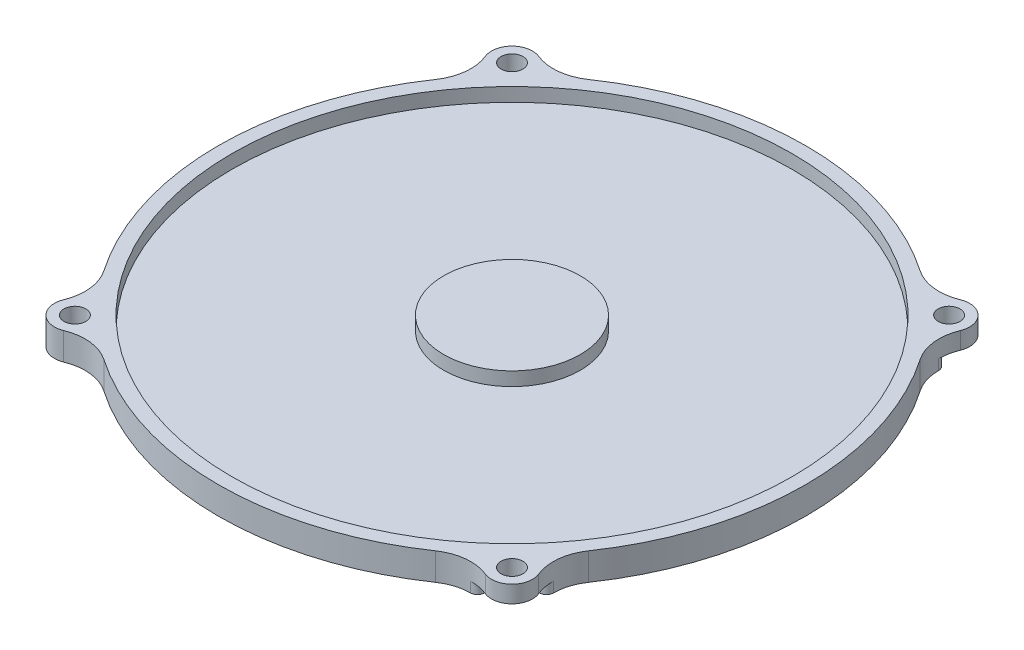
ISO-10303-21;
HEADER;
FILE_DESCRIPTION(('STEP AP214'),'2;1');
FILE_NAME('part.step','',(''),(''),'','','');
FILE_SCHEMA(('AUTOMOTIVE_DESIGN { 1 0 10303 214 1 1 1 1 }'));
ENDSEC;
DATA;
#1=APPLICATION_CONTEXT('core data for automotive mechanical design processes');
#2=APPLICATION_PROTOCOL_DEFINITION('international standard','automotive_design',2000,#1);
#3=PRODUCT_CONTEXT('',#1,'mechanical');
#4=PRODUCT('Part','Part','',(#3));
#5=PRODUCT_RELATED_PRODUCT_CATEGORY('part','',(#4));
#6=PRODUCT_DEFINITION_FORMATION('','',#4);
#7=PRODUCT_DEFINITION_CONTEXT('part definition',#1,'design');
#8=PRODUCT_DEFINITION('design','',#6,#7);
#9=PRODUCT_DEFINITION_SHAPE('','',#8);
#10=(LENGTH_UNIT() NAMED_UNIT(*) SI_UNIT(.MILLI.,.METRE.));
#11=(NAMED_UNIT(*) PLANE_ANGLE_UNIT() SI_UNIT($,.RADIAN.));
#12=(NAMED_UNIT(*) SI_UNIT($,.STERADIAN.) SOLID_ANGLE_UNIT());
#13=UNCERTAINTY_MEASURE_WITH_UNIT(LENGTH_MEASURE(1.E-05),#10,'distance_accuracy_value','');
#14=(GEOMETRIC_REPRESENTATION_CONTEXT(3) GLOBAL_UNCERTAINTY_ASSIGNED_CONTEXT((#13)) GLOBAL_UNIT_ASSIGNED_CONTEXT((#10,
#11,#12)) REPRESENTATION_CONTEXT('',''));
#15=CARTESIAN_POINT('',(0.,0.,0.));
#16=DIRECTION('',(0.,0.,1.));
#17=DIRECTION('',(1.,0.,0.));
#18=AXIS2_PLACEMENT_3D('',#15,#16,#17);
#19=CARTESIAN_POINT('',(31.9999999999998,4.,32.0000000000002));
#20=DIRECTION('',(0.,-1.,0.));
#21=DIRECTION('',(0.,0.,-1.));
#22=AXIS2_PLACEMENT_3D('',#19,#20,#21);
#23=CYLINDRICAL_SURFACE('',#22,3.);
#24=CARTESIAN_POINT('',(32.0000000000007,1.5,32.));
#25=DIRECTION('',(0.,-1.,0.));
#26=DIRECTION('',(0.,0.,-1.));
#27=AXIS2_PLACEMENT_3D('',#24,#25,#26);
#28=CIRCLE('',#27,2.99999999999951);
#29=CARTESIAN_POINT('',(34.7793221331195,1.5,30.8706778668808));
#30=VERTEX_POINT('',#29);
#31=CARTESIAN_POINT('',(30.870677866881,1.5,34.7793221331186));
#32=VERTEX_POINT('',#31);
#33=EDGE_CURVE('E216',#30,#32,#28,.T.);
#34=ORIENTED_EDGE('',*,*,#33,.F.);
#35=DIRECTION('',(0.,-1.,0.));
#36=VECTOR('',#35,1.);
#37=CARTESIAN_POINT('',(34.7793221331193,4.,30.8706778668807));
#38=LINE('',#37,#36);
#39=CARTESIAN_POINT('',(34.7793221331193,4.,30.8706778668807));
#40=VERTEX_POINT('',#39);
#41=EDGE_CURVE('E225',#40,#30,#38,.T.);
#42=ORIENTED_EDGE('',*,*,#41,.F.);
#43=CARTESIAN_POINT('',(31.9999999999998,4.,32.0000000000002));
#44=DIRECTION('',(0.,1.,0.));
#45=DIRECTION('',(0.,0.,-1.));
#46=AXIS2_PLACEMENT_3D('',#43,#44,#45);
#47=CIRCLE('',#46,3.);
#48=CARTESIAN_POINT('',(30.8706778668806,4.,34.7793221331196));
#49=VERTEX_POINT('',#48);
#50=EDGE_CURVE('E223',#49,#40,#47,.T.);
#51=ORIENTED_EDGE('',*,*,#50,.F.);
#52=DIRECTION('',(0.,-1.,0.));
#53=VECTOR('',#52,1.);
#54=CARTESIAN_POINT('',(30.8706778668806,4.,34.7793221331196));
#55=LINE('',#54,#53);
#56=EDGE_CURVE('E208',#49,#32,#55,.T.);
#57=ORIENTED_EDGE('',*,*,#56,.T.);
#58=EDGE_LOOP('',(#34,#42,#51,#57));
#59=FACE_BOUND('',#58,.T.);
#60=ADVANCED_FACE('F41',(#59),#23,.T.);
#61=CARTESIAN_POINT('',(32.0000000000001,4.,-31.9999999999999));
#62=DIRECTION('',(0.,-1.,0.));
#63=DIRECTION('',(0.,0.,-1.));
#64=AXIS2_PLACEMENT_3D('',#61,#62,#63);
#65=CYLINDRICAL_SURFACE('',#64,3.);
#66=CARTESIAN_POINT('',(32.,1.5,-32.));
#67=DIRECTION('',(0.,-1.,0.));
#68=DIRECTION('',(0.,0.,-1.));
#69=AXIS2_PLACEMENT_3D('',#66,#67,#68);
#70=CIRCLE('',#69,3.00000000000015);
#71=CARTESIAN_POINT('',(30.8706778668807,1.5,-34.7793221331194));
#72=VERTEX_POINT('',#71);
#73=CARTESIAN_POINT('',(34.7793221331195,1.5,-30.8706778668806));
#74=VERTEX_POINT('',#73);
#75=EDGE_CURVE('E319',#72,#74,#70,.T.);
#76=ORIENTED_EDGE('',*,*,#75,.F.);
#77=DIRECTION('',(0.,-1.,0.));
#78=VECTOR('',#77,1.);
#79=CARTESIAN_POINT('',(30.8706778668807,4.,-34.7793221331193));
#80=LINE('',#79,#78);
#81=CARTESIAN_POINT('',(30.8706778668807,4.,-34.7793221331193));
#82=VERTEX_POINT('',#81);
#83=EDGE_CURVE('E422',#82,#72,#80,.T.);
#84=ORIENTED_EDGE('',*,*,#83,.F.);
#85=CARTESIAN_POINT('',(32.0000000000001,4.,-31.9999999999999));
#86=DIRECTION('',(0.,1.,0.));
#87=DIRECTION('',(0.,0.,-1.));
#88=AXIS2_PLACEMENT_3D('',#85,#86,#87);
#89=CIRCLE('',#88,3.);
#90=CARTESIAN_POINT('',(34.7793221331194,4.,-30.8706778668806));
#91=VERTEX_POINT('',#90);
#92=EDGE_CURVE('E373',#91,#82,#89,.T.);
#93=ORIENTED_EDGE('',*,*,#92,.F.);
#94=DIRECTION('',(0.,-1.,0.));
#95=VECTOR('',#94,1.);
#96=CARTESIAN_POINT('',(34.7793221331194,4.,-30.8706778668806));
#97=LINE('',#96,#95);
#98=EDGE_CURVE('E424',#91,#74,#97,.T.);
#99=ORIENTED_EDGE('',*,*,#98,.T.);
#100=EDGE_LOOP('',(#76,#84,#93,#99));
#101=FACE_BOUND('',#100,.T.);
#102=ADVANCED_FACE('F462',(#101),#65,.T.);
#103=CARTESIAN_POINT('',(32.,4.,-32.));
#104=DIRECTION('',(0.,-1.,0.));
#105=DIRECTION('',(0.,0.,-1.));
#106=AXIS2_PLACEMENT_3D('',#103,#104,#105);
#107=CYLINDRICAL_SURFACE('',#106,1.6);
#108=CARTESIAN_POINT('',(32.,4.,-32.));
#109=DIRECTION('',(0.,1.,0.));
#110=DIRECTION('',(0.,0.,1.));
#111=AXIS2_PLACEMENT_3D('',#108,#109,#110);
#112=CIRCLE('',#111,1.6);
#113=CARTESIAN_POINT('',(32.,4.,-30.4));
#114=VERTEX_POINT('',#113);
#115=EDGE_CURVE('E340',#114,#114,#112,.T.);
#116=ORIENTED_EDGE('',*,*,#115,.T.);
#117=EDGE_LOOP('',(#116));
#118=FACE_BOUND('',#117,.T.);
#119=CARTESIAN_POINT('',(32.,1.5,-32.));
#120=DIRECTION('',(0.,-1.,0.));
#121=DIRECTION('',(0.,0.,-1.));
#122=AXIS2_PLACEMENT_3D('',#119,#120,#121);
#123=CIRCLE('',#122,1.6);
#124=CARTESIAN_POINT('',(32.,1.5,-33.6));
#125=VERTEX_POINT('',#124);
#126=EDGE_CURVE('E250',#125,#125,#123,.T.);
#127=ORIENTED_EDGE('',*,*,#126,.T.);
#128=EDGE_LOOP('',(#127));
#129=FACE_BOUND('',#128,.T.);
#130=ADVANCED_FACE('F484',(#118,#129),#107,.F.);
#131=CARTESIAN_POINT('',(32.0000000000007,4.,32.));
#132=DIRECTION('',(0.,-1.,0.));
#133=DIRECTION('',(0.,0.,-1.));
#134=AXIS2_PLACEMENT_3D('',#131,#132,#133);
#135=CYLINDRICAL_SURFACE('',#134,1.6);
#136=CARTESIAN_POINT('',(32.0000000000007,4.,32.));
#137=DIRECTION('',(0.,1.,0.));
#138=DIRECTION('',(0.,0.,1.));
#139=AXIS2_PLACEMENT_3D('',#136,#137,#138);
#140=CIRCLE('',#139,1.6);
#141=CARTESIAN_POINT('',(32.0000000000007,4.,33.6));
#142=VERTEX_POINT('',#141);
#143=EDGE_CURVE('E335',#142,#142,#140,.T.);
#144=ORIENTED_EDGE('',*,*,#143,.T.);
#145=EDGE_LOOP('',(#144));
#146=FACE_BOUND('',#145,.T.);
#147=CARTESIAN_POINT('',(32.0000000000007,1.5,32.));
#148=DIRECTION('',(0.,-1.,0.));
#149=DIRECTION('',(0.,0.,-1.));
#150=AXIS2_PLACEMENT_3D('',#147,#148,#149);
#151=CIRCLE('',#150,1.6);
#152=CARTESIAN_POINT('',(32.0000000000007,1.5,30.4));
#153=VERTEX_POINT('',#152);
#154=EDGE_CURVE('E220',#153,#153,#151,.T.);
#155=ORIENTED_EDGE('',*,*,#154,.T.);
#156=EDGE_LOOP('',(#155));
#157=FACE_BOUND('',#156,.T.);
#158=ADVANCED_FACE('F585',(#146,#157),#135,.F.);
#159=CARTESIAN_POINT('',(-20.6322035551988,4.,-14.1177964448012));
#160=DIRECTION('',(0.,-1.,0.));
#161=DIRECTION('',(0.,0.,-1.));
#162=AXIS2_PLACEMENT_3D('',#159,#160,#161);
#163=PLANE('',#162);
#164=CARTESIAN_POINT('',(0.,4.,0.));
#165=DIRECTION('',(0.,1.,0.));
#166=DIRECTION('',(0.,0.,1.));
#167=AXIS2_PLACEMENT_3D('',#164,#165,#166);
#168=CIRCLE('',#167,41.);
#169=CARTESIAN_POINT('',(0.,4.,41.));
#170=VERTEX_POINT('',#169);
#171=EDGE_CURVE('E323',#170,#170,#168,.T.);
#172=ORIENTED_EDGE('',*,*,#171,.F.);
#173=EDGE_LOOP('',(#172));
#174=FACE_BOUND('',#173,.T.);
#175=CARTESIAN_POINT('',(-41.2644071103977,4.,-28.2355928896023));
#176=DIRECTION('',(0.,-1.,0.));
#177=DIRECTION('',(0.,0.,-1.));
#178=AXIS2_PLACEMENT_3D('',#175,#176,#177);
#179=CIRCLE('',#178,7.);
#180=CARTESIAN_POINT('',(-34.7793221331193,4.,-30.8706778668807));
#181=VERTEX_POINT('',#180);
#182=CARTESIAN_POINT('',(-35.487390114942,4.,-24.282609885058));
#183=VERTEX_POINT('',#182);
#184=EDGE_CURVE('E350',#181,#183,#179,.T.);
#185=ORIENTED_EDGE('',*,*,#184,.T.);
#186=CARTESIAN_POINT('',(0.,4.,0.));
#187=DIRECTION('',(0.,1.,0.));
#188=DIRECTION('',(0.,0.,-1.));
#189=AXIS2_PLACEMENT_3D('',#186,#187,#188);
#190=CIRCLE('',#189,43.);
#191=CARTESIAN_POINT('',(-35.487390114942,4.,24.282609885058));
#192=VERTEX_POINT('',#191);
#193=EDGE_CURVE('E353',#183,#192,#190,.T.);
#194=ORIENTED_EDGE('',*,*,#193,.T.);
#195=CARTESIAN_POINT('',(-41.2644071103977,4.,28.2355928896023));
#196=DIRECTION('',(0.,-1.,0.));
#197=DIRECTION('',(0.,0.,1.));
#198=AXIS2_PLACEMENT_3D('',#195,#196,#197);
#199=CIRCLE('',#198,7.);
#200=CARTESIAN_POINT('',(-34.7793221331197,4.,30.8706778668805));
#201=VERTEX_POINT('',#200);
#202=EDGE_CURVE('E356',#192,#201,#199,.T.);
#203=ORIENTED_EDGE('',*,*,#202,.T.);
#204=CARTESIAN_POINT('',(-32.0000000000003,4.,31.9999999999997));
#205=DIRECTION('',(0.,1.,0.));
#206=DIRECTION('',(0.,0.,-1.));
#207=AXIS2_PLACEMENT_3D('',#204,#205,#206);
#208=CIRCLE('',#207,3.);
#209=CARTESIAN_POINT('',(-30.8706778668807,4.,34.7793221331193));
#210=VERTEX_POINT('',#209);
#211=EDGE_CURVE('E358',#201,#210,#208,.T.);
#212=ORIENTED_EDGE('',*,*,#211,.T.);
#213=CARTESIAN_POINT('',(-28.2355928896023,4.,41.2644071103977));
#214=DIRECTION('',(0.,-1.,0.));
#215=DIRECTION('',(0.,0.,-1.));
#216=AXIS2_PLACEMENT_3D('',#213,#214,#215);
#217=CIRCLE('',#216,7.);
#218=CARTESIAN_POINT('',(-24.282609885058,4.,35.487390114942));
#219=VERTEX_POINT('',#218);
#220=EDGE_CURVE('E360',#210,#219,#217,.T.);
#221=ORIENTED_EDGE('',*,*,#220,.T.);
#222=CARTESIAN_POINT('',(0.,4.,0.));
#223=DIRECTION('',(0.,1.,0.));
#224=DIRECTION('',(0.,0.,-1.));
#225=AXIS2_PLACEMENT_3D('',#222,#223,#224);
#226=CIRCLE('',#225,43.);
#227=CARTESIAN_POINT('',(24.282609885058,4.,35.487390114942));
#228=VERTEX_POINT('',#227);
#229=EDGE_CURVE('E362',#219,#228,#226,.T.);
#230=ORIENTED_EDGE('',*,*,#229,.T.);
#231=CARTESIAN_POINT('',(28.2355928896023,4.,41.2644071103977));
#232=DIRECTION('',(0.,-1.,0.));
#233=DIRECTION('',(0.,0.,1.));
#234=AXIS2_PLACEMENT_3D('',#231,#232,#233);
#235=CIRCLE('',#234,7.);
#236=EDGE_CURVE('E364',#228,#49,#235,.T.);
#237=ORIENTED_EDGE('',*,*,#236,.T.);
#238=ORIENTED_EDGE('',*,*,#50,.T.);
#239=CARTESIAN_POINT('',(41.2644071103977,4.,28.2355928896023));
#240=DIRECTION('',(0.,-1.,0.));
#241=DIRECTION('',(0.,0.,-1.));
#242=AXIS2_PLACEMENT_3D('',#239,#240,#241);
#243=CIRCLE('',#242,7.);
#244=CARTESIAN_POINT('',(35.487390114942,4.,24.282609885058));
#245=VERTEX_POINT('',#244);
#246=EDGE_CURVE('E367',#40,#245,#243,.T.);
#247=ORIENTED_EDGE('',*,*,#246,.T.);
#248=CARTESIAN_POINT('',(0.,4.,0.));
#249=DIRECTION('',(0.,1.,0.));
#250=DIRECTION('',(0.,0.,-1.));
#251=AXIS2_PLACEMENT_3D('',#248,#249,#250);
#252=CIRCLE('',#251,43.);
#253=CARTESIAN_POINT('',(35.487390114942,4.,-24.282609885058));
#254=VERTEX_POINT('',#253);
#255=EDGE_CURVE('E369',#245,#254,#252,.T.);
#256=ORIENTED_EDGE('',*,*,#255,.T.);
#257=CARTESIAN_POINT('',(41.2644071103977,4.,-28.2355928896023));
#258=DIRECTION('',(0.,-1.,0.));
#259=DIRECTION('',(0.,0.,1.));
#260=AXIS2_PLACEMENT_3D('',#257,#258,#259);
#261=CIRCLE('',#260,7.);
#262=EDGE_CURVE('E371',#254,#91,#261,.T.);
#263=ORIENTED_EDGE('',*,*,#262,.T.);
#264=ORIENTED_EDGE('',*,*,#92,.T.);
#265=CARTESIAN_POINT('',(28.2355928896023,4.,-41.2644071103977));
#266=DIRECTION('',(0.,-1.,0.));
#267=DIRECTION('',(0.,0.,-1.));
#268=AXIS2_PLACEMENT_3D('',#265,#266,#267);
#269=CIRCLE('',#268,7.);
#270=CARTESIAN_POINT('',(24.282609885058,4.,-35.487390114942));
#271=VERTEX_POINT('',#270);
#272=EDGE_CURVE('E375',#82,#271,#269,.T.);
#273=ORIENTED_EDGE('',*,*,#272,.T.);
#274=CARTESIAN_POINT('',(0.,4.,0.));
#275=DIRECTION('',(0.,1.,0.));
#276=DIRECTION('',(0.,0.,-1.));
#277=AXIS2_PLACEMENT_3D('',#274,#275,#276);
#278=CIRCLE('',#277,43.);
#279=CARTESIAN_POINT('',(-24.282609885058,4.,-35.487390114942));
#280=VERTEX_POINT('',#279);
#281=EDGE_CURVE('E377',#271,#280,#278,.T.);
#282=ORIENTED_EDGE('',*,*,#281,.T.);
#283=CARTESIAN_POINT('',(-28.2355928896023,4.,-41.2644071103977));
#284=DIRECTION('',(0.,-1.,0.));
#285=DIRECTION('',(0.,0.,1.));
#286=AXIS2_PLACEMENT_3D('',#283,#284,#285);
#287=CIRCLE('',#286,7.);
#288=CARTESIAN_POINT('',(-30.8706778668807,4.,-34.7793221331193));
#289=VERTEX_POINT('',#288);
#290=EDGE_CURVE('E379',#280,#289,#287,.T.);
#291=ORIENTED_EDGE('',*,*,#290,.T.);
#292=CARTESIAN_POINT('',(-32.,4.,-32.));
#293=DIRECTION('',(0.,1.,0.));
#294=DIRECTION('',(0.,0.,-1.));
#295=AXIS2_PLACEMENT_3D('',#292,#293,#294);
#296=CIRCLE('',#295,3.);
#297=EDGE_CURVE('E381',#289,#181,#296,.T.);
#298=ORIENTED_EDGE('',*,*,#297,.T.);
#299=EDGE_LOOP('',(#185,#194,#203,#212,#221,#230,#237,#238,#247,#256,#263,#264,#273,#282,#291,#298));
#300=FACE_BOUND('',#299,.T.);
#301=CARTESIAN_POINT('',(-32.,4.,-32.));
#302=DIRECTION('',(0.,1.,0.));
#303=DIRECTION('',(0.,0.,1.));
#304=AXIS2_PLACEMENT_3D('',#301,#302,#303);
#305=CIRCLE('',#304,1.6);
#306=CARTESIAN_POINT('',(-32.,4.,-30.4));
#307=VERTEX_POINT('',#306);
#308=EDGE_CURVE('E344',#307,#307,#305,.T.);
#309=ORIENTED_EDGE('',*,*,#308,.F.);
#310=EDGE_LOOP('',(#309));
#311=FACE_BOUND('',#310,.T.);
#312=ORIENTED_EDGE('',*,*,#115,.F.);
#313=EDGE_LOOP('',(#312));
#314=FACE_BOUND('',#313,.T.);
#315=ORIENTED_EDGE('',*,*,#143,.F.);
#316=EDGE_LOOP('',(#315));
#317=FACE_BOUND('',#316,.T.);
#318=CARTESIAN_POINT('',(-31.9999999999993,4.,32.));
#319=DIRECTION('',(0.,1.,0.));
#320=DIRECTION('',(0.,0.,1.));
#321=AXIS2_PLACEMENT_3D('',#318,#319,#320);
#322=CIRCLE('',#321,1.6);
#323=CARTESIAN_POINT('',(-31.9999999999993,4.,33.6));
#324=VERTEX_POINT('',#323);
#325=EDGE_CURVE('E332',#324,#324,#322,.T.);
#326=ORIENTED_EDGE('',*,*,#325,.F.);
#327=EDGE_LOOP('',(#326));
#328=FACE_BOUND('',#327,.T.);
#329=ADVANCED_FACE('F465',(#174,#300,#311,#314,#317,#328),#163,.F.);
#330=CARTESIAN_POINT('',(-20.6322035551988,0.,-14.1177964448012));
#331=DIRECTION('',(0.,-1.,0.));
#332=DIRECTION('',(0.,0.,-1.));
#333=AXIS2_PLACEMENT_3D('',#330,#331,#332);
#334=PLANE('',#333);
#335=CARTESIAN_POINT('',(28.2355928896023,0.,-41.2644071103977));
#336=DIRECTION('',(0.,-1.,0.));
#337=DIRECTION('',(0.,0.,-1.));
#338=AXIS2_PLACEMENT_3D('',#335,#336,#337);
#339=CIRCLE('',#338,7.);
#340=CARTESIAN_POINT('',(28.2089275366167,0.,-34.2644578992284));
#341=VERTEX_POINT('',#340);
#342=CARTESIAN_POINT('',(24.282609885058,0.,-35.487390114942));
#343=VERTEX_POINT('',#342);
#344=EDGE_CURVE('E404',#341,#343,#339,.T.);
#345=ORIENTED_EDGE('',*,*,#344,.F.);
#346=CARTESIAN_POINT('',(28.2051182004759,0.,-33.2644651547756));
#347=DIRECTION('',(0.,-1.,0.));
#348=DIRECTION('',(0.,0.,-1.));
#349=AXIS2_PLACEMENT_3D('',#346,#347,#348);
#350=CIRCLE('',#349,1.);
#351=CARTESIAN_POINT('',(29.1538386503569,0.,-32.9483488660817));
#352=VERTEX_POINT('',#351);
#353=EDGE_CURVE('E264',#341,#352,#350,.T.);
#354=ORIENTED_EDGE('',*,*,#353,.T.);
#355=CARTESIAN_POINT('',(32.,0.,-32.));
#356=DIRECTION('',(0.,-1.,0.));
#357=DIRECTION('',(0.,0.,-1.));
#358=AXIS2_PLACEMENT_3D('',#355,#356,#357);
#359=CIRCLE('',#358,3.00000000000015);
#360=CARTESIAN_POINT('',(32.9483488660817,0.,-29.1538386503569));
#361=VERTEX_POINT('',#360);
#362=EDGE_CURVE('E311',#361,#352,#359,.T.);
#363=ORIENTED_EDGE('',*,*,#362,.F.);
#364=CARTESIAN_POINT('',(33.2644651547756,0.,-28.2051182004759));
#365=DIRECTION('',(0.,-1.,0.));
#366=DIRECTION('',(0.,0.,-1.));
#367=AXIS2_PLACEMENT_3D('',#364,#365,#366);
#368=CIRCLE('',#367,1.);
#369=CARTESIAN_POINT('',(34.2644578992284,0.,-28.2089275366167));
#370=VERTEX_POINT('',#369);
#371=EDGE_CURVE('E262',#361,#370,#368,.T.);
#372=ORIENTED_EDGE('',*,*,#371,.T.);
#373=CARTESIAN_POINT('',(41.2644071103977,0.,-28.2355928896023));
#374=DIRECTION('',(0.,-1.,0.));
#375=DIRECTION('',(0.,0.,1.));
#376=AXIS2_PLACEMENT_3D('',#373,#374,#375);
#377=CIRCLE('',#376,7.);
#378=CARTESIAN_POINT('',(35.487390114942,0.,-24.282609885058));
#379=VERTEX_POINT('',#378);
#380=EDGE_CURVE('E401',#379,#370,#377,.T.);
#381=ORIENTED_EDGE('',*,*,#380,.F.);
#382=CARTESIAN_POINT('',(0.,0.,0.));
#383=DIRECTION('',(0.,1.,0.));
#384=DIRECTION('',(0.,0.,-1.));
#385=AXIS2_PLACEMENT_3D('',#382,#383,#384);
#386=CIRCLE('',#385,43.);
#387=CARTESIAN_POINT('',(35.487390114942,0.,24.282609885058));
#388=VERTEX_POINT('',#387);
#389=EDGE_CURVE('E399',#388,#379,#386,.T.);
#390=ORIENTED_EDGE('',*,*,#389,.F.);
#391=CARTESIAN_POINT('',(41.2644071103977,0.,28.2355928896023));
#392=DIRECTION('',(0.,-1.,0.));
#393=DIRECTION('',(0.,0.,-1.));
#394=AXIS2_PLACEMENT_3D('',#391,#392,#393);
#395=CIRCLE('',#394,7.);
#396=CARTESIAN_POINT('',(34.2644578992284,0.,28.2089275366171));
#397=VERTEX_POINT('',#396);
#398=EDGE_CURVE('E307',#397,#388,#395,.T.);
#399=ORIENTED_EDGE('',*,*,#398,.F.);
#400=CARTESIAN_POINT('',(33.2644651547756,0.,28.2051182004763));
#401=DIRECTION('',(0.,-1.,0.));
#402=DIRECTION('',(0.,0.,-1.));
#403=AXIS2_PLACEMENT_3D('',#400,#401,#402);
#404=CIRCLE('',#403,1.);
#405=CARTESIAN_POINT('',(32.9483488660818,0.,29.1538386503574));
#406=VERTEX_POINT('',#405);
#407=EDGE_CURVE('E260',#397,#406,#404,.T.);
#408=ORIENTED_EDGE('',*,*,#407,.T.);
#409=CARTESIAN_POINT('',(32.0000000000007,0.,32.));
#410=DIRECTION('',(0.,-1.,0.));
#411=DIRECTION('',(0.,0.,-1.));
#412=AXIS2_PLACEMENT_3D('',#409,#410,#411);
#413=CIRCLE('',#412,2.99999999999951);
#414=CARTESIAN_POINT('',(29.1538386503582,0.,32.9483488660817));
#415=VERTEX_POINT('',#414);
#416=EDGE_CURVE('E305',#415,#406,#413,.T.);
#417=ORIENTED_EDGE('',*,*,#416,.F.);
#418=CARTESIAN_POINT('',(28.2051182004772,0.,33.2644651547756));
#419=DIRECTION('',(0.,-1.,0.));
#420=DIRECTION('',(0.,0.,-1.));
#421=AXIS2_PLACEMENT_3D('',#418,#419,#420);
#422=CIRCLE('',#421,1.);
#423=CARTESIAN_POINT('',(28.2089275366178,0.,34.2644578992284));
#424=VERTEX_POINT('',#423);
#425=EDGE_CURVE('E258',#415,#424,#422,.T.);
#426=ORIENTED_EDGE('',*,*,#425,.T.);
#427=CARTESIAN_POINT('',(28.2355928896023,0.,41.2644071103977));
#428=DIRECTION('',(0.,-1.,0.));
#429=DIRECTION('',(0.,0.,1.));
#430=AXIS2_PLACEMENT_3D('',#427,#428,#429);
#431=CIRCLE('',#430,7.);
#432=CARTESIAN_POINT('',(24.282609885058,0.,35.487390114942));
#433=VERTEX_POINT('',#432);
#434=EDGE_CURVE('E396',#433,#424,#431,.T.);
#435=ORIENTED_EDGE('',*,*,#434,.F.);
#436=CARTESIAN_POINT('',(0.,0.,0.));
#437=DIRECTION('',(0.,1.,0.));
#438=DIRECTION('',(0.,0.,-1.));
#439=AXIS2_PLACEMENT_3D('',#436,#437,#438);
#440=CIRCLE('',#439,43.);
#441=CARTESIAN_POINT('',(-24.282609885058,0.,35.487390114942));
#442=VERTEX_POINT('',#441);
#443=EDGE_CURVE('E394',#442,#433,#440,.T.);
#444=ORIENTED_EDGE('',*,*,#443,.F.);
#445=CARTESIAN_POINT('',(-28.2355928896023,0.,41.2644071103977));
#446=DIRECTION('',(0.,-1.,0.));
#447=DIRECTION('',(0.,0.,-1.));
#448=AXIS2_PLACEMENT_3D('',#445,#446,#447);
#449=CIRCLE('',#448,7.);
#450=CARTESIAN_POINT('',(-30.8706778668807,0.,34.7793221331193));
#451=VERTEX_POINT('',#450);
#452=EDGE_CURVE('E392',#451,#442,#449,.T.);
#453=ORIENTED_EDGE('',*,*,#452,.F.);
#454=CARTESIAN_POINT('',(-32.0000000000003,0.,31.9999999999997));
#455=DIRECTION('',(0.,1.,0.));
#456=DIRECTION('',(0.,0.,-1.));
#457=AXIS2_PLACEMENT_3D('',#454,#455,#456);
#458=CIRCLE('',#457,3.);
#459=CARTESIAN_POINT('',(-34.7793221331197,0.,30.8706778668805));
#460=VERTEX_POINT('',#459);
#461=EDGE_CURVE('E390',#460,#451,#458,.T.);
#462=ORIENTED_EDGE('',*,*,#461,.F.);
#463=CARTESIAN_POINT('',(-41.2644071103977,0.,28.2355928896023));
#464=DIRECTION('',(0.,-1.,0.));
#465=DIRECTION('',(0.,0.,1.));
#466=AXIS2_PLACEMENT_3D('',#463,#464,#465);
#467=CIRCLE('',#466,7.);
#468=CARTESIAN_POINT('',(-35.487390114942,0.,24.282609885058));
#469=VERTEX_POINT('',#468);
#470=EDGE_CURVE('E388',#469,#460,#467,.T.);
#471=ORIENTED_EDGE('',*,*,#470,.F.);
#472=CARTESIAN_POINT('',(0.,0.,0.));
#473=DIRECTION('',(0.,1.,0.));
#474=DIRECTION('',(0.,0.,-1.));
#475=AXIS2_PLACEMENT_3D('',#472,#473,#474);
#476=CIRCLE('',#475,43.);
#477=CARTESIAN_POINT('',(-35.487390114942,0.,-24.282609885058));
#478=VERTEX_POINT('',#477);
#479=EDGE_CURVE('E386',#478,#469,#476,.T.);
#480=ORIENTED_EDGE('',*,*,#479,.F.);
#481=CARTESIAN_POINT('',(-41.2644071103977,0.,-28.2355928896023));
#482=DIRECTION('',(0.,-1.,0.));
#483=DIRECTION('',(0.,0.,-1.));
#484=AXIS2_PLACEMENT_3D('',#481,#482,#483);
#485=CIRCLE('',#484,7.);
#486=CARTESIAN_POINT('',(-34.7793221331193,0.,-30.8706778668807));
#487=VERTEX_POINT('',#486);
#488=EDGE_CURVE('E347',#487,#478,#485,.T.);
#489=ORIENTED_EDGE('',*,*,#488,.F.);
#490=CARTESIAN_POINT('',(-32.,0.,-32.));
#491=DIRECTION('',(0.,1.,0.));
#492=DIRECTION('',(0.,0.,-1.));
#493=AXIS2_PLACEMENT_3D('',#490,#491,#492);
#494=CIRCLE('',#493,3.);
#495=CARTESIAN_POINT('',(-30.8706778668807,0.,-34.7793221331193));
#496=VERTEX_POINT('',#495);
#497=EDGE_CURVE('E354',#496,#487,#494,.T.);
#498=ORIENTED_EDGE('',*,*,#497,.F.);
#499=CARTESIAN_POINT('',(-28.2355928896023,0.,-41.2644071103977));
#500=DIRECTION('',(0.,-1.,0.));
#501=DIRECTION('',(0.,0.,1.));
#502=AXIS2_PLACEMENT_3D('',#499,#500,#501);
#503=CIRCLE('',#502,7.);
#504=CARTESIAN_POINT('',(-24.282609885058,0.,-35.487390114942));
#505=VERTEX_POINT('',#504);
#506=EDGE_CURVE('E408',#505,#496,#503,.T.);
#507=ORIENTED_EDGE('',*,*,#506,.F.);
#508=CARTESIAN_POINT('',(0.,0.,0.));
#509=DIRECTION('',(0.,1.,0.));
#510=DIRECTION('',(0.,0.,-1.));
#511=AXIS2_PLACEMENT_3D('',#508,#509,#510);
#512=CIRCLE('',#511,43.);
#513=EDGE_CURVE('E406',#343,#505,#512,.T.);
#514=ORIENTED_EDGE('',*,*,#513,.F.);
#515=EDGE_LOOP('',(#345,#354,#363,#372,#381,#390,#399,#408,#417,#426,#435,#444,#453,#462,#471,
#480,#489,#498,#507,#514));
#516=FACE_BOUND('',#515,.T.);
#517=CARTESIAN_POINT('',(-32.,0.,-32.));
#518=DIRECTION('',(0.,1.,0.));
#519=DIRECTION('',(0.,0.,1.));
#520=AXIS2_PLACEMENT_3D('',#517,#518,#519);
#521=CIRCLE('',#520,1.6);
#522=CARTESIAN_POINT('',(-32.,0.,-30.4));
#523=VERTEX_POINT('',#522);
#524=EDGE_CURVE('E343',#523,#523,#521,.T.);
#525=ORIENTED_EDGE('',*,*,#524,.T.);
#526=EDGE_LOOP('',(#525));
#527=FACE_BOUND('',#526,.T.);
#528=CARTESIAN_POINT('',(-31.9999999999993,0.,32.));
#529=DIRECTION('',(0.,1.,0.));
#530=DIRECTION('',(0.,0.,1.));
#531=AXIS2_PLACEMENT_3D('',#528,#529,#530);
#532=CIRCLE('',#531,1.6);
#533=CARTESIAN_POINT('',(-31.9999999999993,0.,33.6));
#534=VERTEX_POINT('',#533);
#535=EDGE_CURVE('E329',#534,#534,#532,.T.);
#536=ORIENTED_EDGE('',*,*,#535,.T.);
#537=EDGE_LOOP('',(#536));
#538=FACE_BOUND('',#537,.T.);
#539=ADVANCED_FACE('F303',(#516,#527,#538),#334,.T.);
#540=CARTESIAN_POINT('',(-41.2644071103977,4.,-28.2355928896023));
#541=DIRECTION('',(0.,-1.,0.));
#542=DIRECTION('',(0.,0.,-1.));
#543=AXIS2_PLACEMENT_3D('',#540,#541,#542);
#544=CYLINDRICAL_SURFACE('',#543,7.);
#545=ORIENTED_EDGE('',*,*,#488,.T.);
#546=DIRECTION('',(0.,-1.,0.));
#547=VECTOR('',#546,1.);
#548=CARTESIAN_POINT('',(-35.487390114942,4.,-24.282609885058));
#549=LINE('',#548,#547);
#550=EDGE_CURVE('E245',#183,#478,#549,.T.);
#551=ORIENTED_EDGE('',*,*,#550,.F.);
#552=ORIENTED_EDGE('',*,*,#184,.F.);
#553=DIRECTION('',(0.,-1.,0.));
#554=VECTOR('',#553,1.);
#555=CARTESIAN_POINT('',(-34.7793221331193,4.,-30.8706778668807));
#556=LINE('',#555,#554);
#557=EDGE_CURVE('E383',#181,#487,#556,.T.);
#558=ORIENTED_EDGE('',*,*,#557,.T.);
#559=EDGE_LOOP('',(#545,#551,#552,#558));
#560=FACE_BOUND('',#559,.T.);
#561=ADVANCED_FACE('F509',(#560),#544,.F.);
#562=CARTESIAN_POINT('',(0.,4.,0.));
#563=DIRECTION('',(0.,-1.,0.));
#564=DIRECTION('',(0.,0.,-1.));
#565=AXIS2_PLACEMENT_3D('',#562,#563,#564);
#566=CYLINDRICAL_SURFACE('',#565,43.);
#567=ORIENTED_EDGE('',*,*,#479,.T.);
#568=DIRECTION('',(0.,-1.,0.));
#569=VECTOR('',#568,1.);
#570=CARTESIAN_POINT('',(-35.487390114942,4.,24.282609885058));
#571=LINE('',#570,#569);
#572=EDGE_CURVE('E242',#192,#469,#571,.T.);
#573=ORIENTED_EDGE('',*,*,#572,.F.);
#574=ORIENTED_EDGE('',*,*,#193,.F.);
#575=ORIENTED_EDGE('',*,*,#550,.T.);
#576=EDGE_LOOP('',(#567,#573,#574,#575));
#577=FACE_BOUND('',#576,.T.);
#578=ADVANCED_FACE('F505',(#577),#566,.T.);
#579=CARTESIAN_POINT('',(-41.2644071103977,4.,28.2355928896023));
#580=DIRECTION('',(0.,-1.,0.));
#581=DIRECTION('',(0.,0.,-1.));
#582=AXIS2_PLACEMENT_3D('',#579,#580,#581);
#583=CYLINDRICAL_SURFACE('',#582,7.);
#584=ORIENTED_EDGE('',*,*,#470,.T.);
#585=DIRECTION('',(0.,-1.,0.));
#586=VECTOR('',#585,1.);
#587=CARTESIAN_POINT('',(-34.7793221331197,4.,30.8706778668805));
#588=LINE('',#587,#586);
#589=EDGE_CURVE('E239',#201,#460,#588,.T.);
#590=ORIENTED_EDGE('',*,*,#589,.F.);
#591=ORIENTED_EDGE('',*,*,#202,.F.);
#592=ORIENTED_EDGE('',*,*,#572,.T.);
#593=EDGE_LOOP('',(#584,#590,#591,#592));
#594=FACE_BOUND('',#593,.T.);
#595=ADVANCED_FACE('F501',(#594),#583,.F.);
#596=CARTESIAN_POINT('',(-32.0000000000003,4.,31.9999999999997));
#597=DIRECTION('',(0.,-1.,0.));
#598=DIRECTION('',(0.,0.,-1.));
#599=AXIS2_PLACEMENT_3D('',#596,#597,#598);
#600=CYLINDRICAL_SURFACE('',#599,3.);
#601=ORIENTED_EDGE('',*,*,#461,.T.);
#602=DIRECTION('',(0.,-1.,0.));
#603=VECTOR('',#602,1.);
#604=CARTESIAN_POINT('',(-30.8706778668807,4.,34.7793221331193));
#605=LINE('',#604,#603);
#606=EDGE_CURVE('E236',#210,#451,#605,.T.);
#607=ORIENTED_EDGE('',*,*,#606,.F.);
#608=ORIENTED_EDGE('',*,*,#211,.F.);
#609=ORIENTED_EDGE('',*,*,#589,.T.);
#610=EDGE_LOOP('',(#601,#607,#608,#609));
#611=FACE_BOUND('',#610,.T.);
#612=ADVANCED_FACE('F497',(#611),#600,.T.);
#613=CARTESIAN_POINT('',(-28.2355928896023,4.,41.2644071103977));
#614=DIRECTION('',(0.,-1.,0.));
#615=DIRECTION('',(0.,0.,-1.));
#616=AXIS2_PLACEMENT_3D('',#613,#614,#615);
#617=CYLINDRICAL_SURFACE('',#616,7.);
#618=ORIENTED_EDGE('',*,*,#452,.T.);
#619=DIRECTION('',(0.,-1.,0.));
#620=VECTOR('',#619,1.);
#621=CARTESIAN_POINT('',(-24.282609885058,4.,35.487390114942));
#622=LINE('',#621,#620);
#623=EDGE_CURVE('E228',#219,#442,#622,.T.);
#624=ORIENTED_EDGE('',*,*,#623,.F.);
#625=ORIENTED_EDGE('',*,*,#220,.F.);
#626=ORIENTED_EDGE('',*,*,#606,.T.);
#627=EDGE_LOOP('',(#618,#624,#625,#626));
#628=FACE_BOUND('',#627,.T.);
#629=ADVANCED_FACE('F494',(#628),#617,.F.);
#630=CARTESIAN_POINT('',(0.,4.,0.));
#631=DIRECTION('',(0.,-1.,0.));
#632=DIRECTION('',(0.,0.,-1.));
#633=AXIS2_PLACEMENT_3D('',#630,#631,#632);
#634=CYLINDRICAL_SURFACE('',#633,43.);
#635=ORIENTED_EDGE('',*,*,#443,.T.);
#636=DIRECTION('',(0.,-1.,0.));
#637=VECTOR('',#636,1.);
#638=CARTESIAN_POINT('',(24.282609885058,4.,35.487390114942));
#639=LINE('',#638,#637);
#640=EDGE_CURVE('E224',#228,#433,#639,.T.);
#641=ORIENTED_EDGE('',*,*,#640,.F.);
#642=ORIENTED_EDGE('',*,*,#229,.F.);
#643=ORIENTED_EDGE('',*,*,#623,.T.);
#644=EDGE_LOOP('',(#635,#641,#642,#643));
#645=FACE_BOUND('',#644,.T.);
#646=ADVANCED_FACE('F491',(#645),#634,.T.);
#647=CARTESIAN_POINT('',(28.2355928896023,4.,41.2644071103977));
#648=DIRECTION('',(0.,-1.,0.));
#649=DIRECTION('',(0.,0.,-1.));
#650=AXIS2_PLACEMENT_3D('',#647,#648,#649);
#651=CYLINDRICAL_SURFACE('',#650,7.);
#652=ORIENTED_EDGE('',*,*,#434,.T.);
#653=DIRECTION('',(0.,-1.,0.));
#654=VECTOR('',#653,1.);
#655=CARTESIAN_POINT('',(28.2089275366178,4.,34.2644578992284));
#656=LINE('',#655,#654);
#657=CARTESIAN_POINT('',(28.2089275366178,1.5,34.2644578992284));
#658=VERTEX_POINT('',#657);
#659=EDGE_CURVE('E211',#424,#658,#656,.F.);
#660=ORIENTED_EDGE('',*,*,#659,.T.);
#661=CARTESIAN_POINT('',(28.2355928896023,1.5,41.2644071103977));
#662=DIRECTION('',(0.,-1.,0.));
#663=DIRECTION('',(0.,0.,-1.));
#664=AXIS2_PLACEMENT_3D('',#661,#662,#663);
#665=CIRCLE('',#664,7.);
#666=EDGE_CURVE('E203',#658,#32,#665,.T.);
#667=ORIENTED_EDGE('',*,*,#666,.T.);
#668=ORIENTED_EDGE('',*,*,#56,.F.);
#669=ORIENTED_EDGE('',*,*,#236,.F.);
#670=ORIENTED_EDGE('',*,*,#640,.T.);
#671=EDGE_LOOP('',(#652,#660,#667,#668,#669,#670));
#672=FACE_BOUND('',#671,.T.);
#673=ADVANCED_FACE('F205',(#672),#651,.F.);
#674=CARTESIAN_POINT('',(41.2644071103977,4.,28.2355928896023));
#675=DIRECTION('',(0.,-1.,0.));
#676=DIRECTION('',(0.,0.,-1.));
#677=AXIS2_PLACEMENT_3D('',#674,#675,#676);
#678=CYLINDRICAL_SURFACE('',#677,7.);
#679=CARTESIAN_POINT('',(41.2644071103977,1.5,28.2355928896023));
#680=DIRECTION('',(0.,-1.,0.));
#681=DIRECTION('',(0.,0.,-1.));
#682=AXIS2_PLACEMENT_3D('',#679,#680,#681);
#683=CIRCLE('',#682,7.);
#684=CARTESIAN_POINT('',(34.2644578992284,1.5,28.2089275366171));
#685=VERTEX_POINT('',#684);
#686=EDGE_CURVE('E56',#30,#685,#683,.T.);
#687=ORIENTED_EDGE('',*,*,#686,.T.);
#688=DIRECTION('',(0.,-1.,0.));
#689=VECTOR('',#688,1.);
#690=CARTESIAN_POINT('',(34.2644578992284,4.,28.2089275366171));
#691=LINE('',#690,#689);
#692=EDGE_CURVE('E277',#685,#397,#691,.T.);
#693=ORIENTED_EDGE('',*,*,#692,.T.);
#694=ORIENTED_EDGE('',*,*,#398,.T.);
#695=DIRECTION('',(0.,-1.,0.));
#696=VECTOR('',#695,1.);
#697=CARTESIAN_POINT('',(35.487390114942,4.,24.282609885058));
#698=LINE('',#697,#696);
#699=EDGE_CURVE('E230',#245,#388,#698,.T.);
#700=ORIENTED_EDGE('',*,*,#699,.F.);
#701=ORIENTED_EDGE('',*,*,#246,.F.);
#702=ORIENTED_EDGE('',*,*,#41,.T.);
#703=EDGE_LOOP('',(#687,#693,#694,#700,#701,#702));
#704=FACE_BOUND('',#703,.T.);
#705=ADVANCED_FACE('F295',(#704),#678,.F.);
#706=CARTESIAN_POINT('',(0.,4.,0.));
#707=DIRECTION('',(0.,-1.,0.));
#708=DIRECTION('',(0.,0.,-1.));
#709=AXIS2_PLACEMENT_3D('',#706,#707,#708);
#710=CYLINDRICAL_SURFACE('',#709,43.);
#711=ORIENTED_EDGE('',*,*,#389,.T.);
#712=DIRECTION('',(0.,-1.,0.));
#713=VECTOR('',#712,1.);
#714=CARTESIAN_POINT('',(35.487390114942,4.,-24.282609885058));
#715=LINE('',#714,#713);
#716=EDGE_CURVE('E427',#254,#379,#715,.T.);
#717=ORIENTED_EDGE('',*,*,#716,.F.);
#718=ORIENTED_EDGE('',*,*,#255,.F.);
#719=ORIENTED_EDGE('',*,*,#699,.T.);
#720=EDGE_LOOP('',(#711,#717,#718,#719));
#721=FACE_BOUND('',#720,.T.);
#722=ADVANCED_FACE('F433',(#721),#710,.T.);
#723=CARTESIAN_POINT('',(41.2644071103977,4.,-28.2355928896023));
#724=DIRECTION('',(0.,-1.,0.));
#725=DIRECTION('',(0.,0.,-1.));
#726=AXIS2_PLACEMENT_3D('',#723,#724,#725);
#727=CYLINDRICAL_SURFACE('',#726,7.);
#728=ORIENTED_EDGE('',*,*,#380,.T.);
#729=DIRECTION('',(0.,-1.,0.));
#730=VECTOR('',#729,1.);
#731=CARTESIAN_POINT('',(34.2644578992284,4.,-28.2089275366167));
#732=LINE('',#731,#730);
#733=CARTESIAN_POINT('',(34.2644578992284,1.5,-28.2089275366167));
#734=VERTEX_POINT('',#733);
#735=EDGE_CURVE('E273',#370,#734,#732,.F.);
#736=ORIENTED_EDGE('',*,*,#735,.T.);
#737=CARTESIAN_POINT('',(41.2644071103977,1.5,-28.2355928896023));
#738=DIRECTION('',(0.,-1.,0.));
#739=DIRECTION('',(0.,0.,-1.));
#740=AXIS2_PLACEMENT_3D('',#737,#738,#739);
#741=CIRCLE('',#740,7.);
#742=EDGE_CURVE('E271',#734,#74,#741,.T.);
#743=ORIENTED_EDGE('',*,*,#742,.T.);
#744=ORIENTED_EDGE('',*,*,#98,.F.);
#745=ORIENTED_EDGE('',*,*,#262,.F.);
#746=ORIENTED_EDGE('',*,*,#716,.T.);
#747=EDGE_LOOP('',(#728,#736,#743,#744,#745,#746));
#748=FACE_BOUND('',#747,.T.);
#749=ADVANCED_FACE('F439',(#748),#727,.F.);
#750=CARTESIAN_POINT('',(28.2355928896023,4.,-41.2644071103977));
#751=DIRECTION('',(0.,-1.,0.));
#752=DIRECTION('',(0.,0.,-1.));
#753=AXIS2_PLACEMENT_3D('',#750,#751,#752);
#754=CYLINDRICAL_SURFACE('',#753,7.);
#755=CARTESIAN_POINT('',(28.2355928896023,1.5,-41.2644071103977));
#756=DIRECTION('',(0.,-1.,0.));
#757=DIRECTION('',(0.,0.,-1.));
#758=AXIS2_PLACEMENT_3D('',#755,#756,#757);
#759=CIRCLE('',#758,7.);
#760=CARTESIAN_POINT('',(28.2089275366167,1.5,-34.2644578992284));
#761=VERTEX_POINT('',#760);
#762=EDGE_CURVE('E64',#72,#761,#759,.T.);
#763=ORIENTED_EDGE('',*,*,#762,.T.);
#764=DIRECTION('',(0.,-1.,0.));
#765=VECTOR('',#764,1.);
#766=CARTESIAN_POINT('',(28.2089275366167,4.,-34.2644578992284));
#767=LINE('',#766,#765);
#768=EDGE_CURVE('E255',#761,#341,#767,.T.);
#769=ORIENTED_EDGE('',*,*,#768,.T.);
#770=ORIENTED_EDGE('',*,*,#344,.T.);
#771=DIRECTION('',(0.,-1.,0.));
#772=VECTOR('',#771,1.);
#773=CARTESIAN_POINT('',(24.282609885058,4.,-35.487390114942));
#774=LINE('',#773,#772);
#775=EDGE_CURVE('E419',#271,#343,#774,.T.);
#776=ORIENTED_EDGE('',*,*,#775,.F.);
#777=ORIENTED_EDGE('',*,*,#272,.F.);
#778=ORIENTED_EDGE('',*,*,#83,.T.);
#779=EDGE_LOOP('',(#763,#769,#770,#776,#777,#778));
#780=FACE_BOUND('',#779,.T.);
#781=ADVANCED_FACE('F455',(#780),#754,.F.);
#782=CARTESIAN_POINT('',(0.,4.,0.));
#783=DIRECTION('',(0.,-1.,0.));
#784=DIRECTION('',(0.,0.,-1.));
#785=AXIS2_PLACEMENT_3D('',#782,#783,#784);
#786=CYLINDRICAL_SURFACE('',#785,43.);
#787=ORIENTED_EDGE('',*,*,#513,.T.);
#788=DIRECTION('',(0.,-1.,0.));
#789=VECTOR('',#788,1.);
#790=CARTESIAN_POINT('',(-24.282609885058,4.,-35.487390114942));
#791=LINE('',#790,#789);
#792=EDGE_CURVE('E416',#280,#505,#791,.T.);
#793=ORIENTED_EDGE('',*,*,#792,.F.);
#794=ORIENTED_EDGE('',*,*,#281,.F.);
#795=ORIENTED_EDGE('',*,*,#775,.T.);
#796=EDGE_LOOP('',(#787,#793,#794,#795));
#797=FACE_BOUND('',#796,.T.);
#798=ADVANCED_FACE('F668',(#797),#786,.T.);
#799=CARTESIAN_POINT('',(-28.2355928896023,4.,-41.2644071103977));
#800=DIRECTION('',(0.,-1.,0.));
#801=DIRECTION('',(0.,0.,-1.));
#802=AXIS2_PLACEMENT_3D('',#799,#800,#801);
#803=CYLINDRICAL_SURFACE('',#802,7.);
#804=ORIENTED_EDGE('',*,*,#506,.T.);
#805=DIRECTION('',(0.,-1.,0.));
#806=VECTOR('',#805,1.);
#807=CARTESIAN_POINT('',(-30.8706778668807,4.,-34.7793221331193));
#808=LINE('',#807,#806);
#809=EDGE_CURVE('E413',#289,#496,#808,.T.);
#810=ORIENTED_EDGE('',*,*,#809,.F.);
#811=ORIENTED_EDGE('',*,*,#290,.F.);
#812=ORIENTED_EDGE('',*,*,#792,.T.);
#813=EDGE_LOOP('',(#804,#810,#811,#812));
#814=FACE_BOUND('',#813,.T.);
#815=ADVANCED_FACE('F659',(#814),#803,.F.);
#816=CARTESIAN_POINT('',(-32.,4.,-32.));
#817=DIRECTION('',(0.,-1.,0.));
#818=DIRECTION('',(0.,0.,-1.));
#819=AXIS2_PLACEMENT_3D('',#816,#817,#818);
#820=CYLINDRICAL_SURFACE('',#819,3.);
#821=ORIENTED_EDGE('',*,*,#497,.T.);
#822=ORIENTED_EDGE('',*,*,#557,.F.);
#823=ORIENTED_EDGE('',*,*,#297,.F.);
#824=ORIENTED_EDGE('',*,*,#809,.T.);
#825=EDGE_LOOP('',(#821,#822,#823,#824));
#826=FACE_BOUND('',#825,.T.);
#827=ADVANCED_FACE('F650',(#826),#820,.T.);
#828=CARTESIAN_POINT('',(-32.,4.,-32.));
#829=DIRECTION('',(0.,-1.,0.));
#830=DIRECTION('',(0.,0.,-1.));
#831=AXIS2_PLACEMENT_3D('',#828,#829,#830);
#832=CYLINDRICAL_SURFACE('',#831,1.6);
#833=ORIENTED_EDGE('',*,*,#308,.T.);
#834=EDGE_LOOP('',(#833));
#835=FACE_BOUND('',#834,.T.);
#836=ORIENTED_EDGE('',*,*,#524,.F.);
#837=EDGE_LOOP('',(#836));
#838=FACE_BOUND('',#837,.T.);
#839=ADVANCED_FACE('F641',(#835,#838),#832,.F.);
#840=CARTESIAN_POINT('',(-31.9999999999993,4.,32.));
#841=DIRECTION('',(0.,-1.,0.));
#842=DIRECTION('',(0.,0.,-1.));
#843=AXIS2_PLACEMENT_3D('',#840,#841,#842);
#844=CYLINDRICAL_SURFACE('',#843,1.6);
#845=ORIENTED_EDGE('',*,*,#325,.T.);
#846=EDGE_LOOP('',(#845));
#847=FACE_BOUND('',#846,.T.);
#848=ORIENTED_EDGE('',*,*,#535,.F.);
#849=EDGE_LOOP('',(#848));
#850=FACE_BOUND('',#849,.T.);
#851=ADVANCED_FACE('F624',(#847,#850),#844,.F.);
#852=CARTESIAN_POINT('',(0.,2.,0.));
#853=DIRECTION('',(0.,1.,0.));
#854=DIRECTION('',(0.,0.,1.));
#855=AXIS2_PLACEMENT_3D('',#852,#853,#854);
#856=CYLINDRICAL_SURFACE('',#855,41.);
#857=CARTESIAN_POINT('',(0.,2.,0.));
#858=DIRECTION('',(0.,1.,0.));
#859=DIRECTION('',(0.,0.,1.));
#860=AXIS2_PLACEMENT_3D('',#857,#858,#859);
#861=CIRCLE('',#860,41.);
#862=CARTESIAN_POINT('',(0.,2.,41.));
#863=VERTEX_POINT('',#862);
#864=EDGE_CURVE('E326',#863,#863,#861,.T.);
#865=ORIENTED_EDGE('',*,*,#864,.F.);
#866=EDGE_LOOP('',(#865));
#867=FACE_BOUND('',#866,.T.);
#868=ORIENTED_EDGE('',*,*,#171,.T.);
#869=EDGE_LOOP('',(#868));
#870=FACE_BOUND('',#869,.T.);
#871=ADVANCED_FACE('F615',(#867,#870),#856,.F.);
#872=CARTESIAN_POINT('',(0.,2.,0.));
#873=DIRECTION('',(0.,1.,0.));
#874=DIRECTION('',(0.,0.,1.));
#875=AXIS2_PLACEMENT_3D('',#872,#873,#874);
#876=PLANE('',#875);
#877=CARTESIAN_POINT('',(0.,2.,0.));
#878=DIRECTION('',(0.,1.,0.));
#879=DIRECTION('',(0.,0.,1.));
#880=AXIS2_PLACEMENT_3D('',#877,#878,#879);
#881=CIRCLE('',#880,10.);
#882=CARTESIAN_POINT('',(0.,2.,10.));
#883=VERTEX_POINT('',#882);
#884=EDGE_CURVE('E320',#883,#883,#881,.T.);
#885=ORIENTED_EDGE('',*,*,#884,.F.);
#886=EDGE_LOOP('',(#885));
#887=FACE_BOUND('',#886,.T.);
#888=ORIENTED_EDGE('',*,*,#864,.T.);
#889=EDGE_LOOP('',(#888));
#890=FACE_BOUND('',#889,.T.);
#891=ADVANCED_FACE('F606',(#887,#890),#876,.T.);
#892=CARTESIAN_POINT('',(0.,2.,0.));
#893=DIRECTION('',(0.,1.,0.));
#894=DIRECTION('',(0.,0.,1.));
#895=AXIS2_PLACEMENT_3D('',#892,#893,#894);
#896=CYLINDRICAL_SURFACE('',#895,10.);
#897=ORIENTED_EDGE('',*,*,#884,.T.);
#898=EDGE_LOOP('',(#897));
#899=FACE_BOUND('',#898,.T.);
#900=CARTESIAN_POINT('',(0.,4.,0.));
#901=DIRECTION('',(0.,1.,0.));
#902=DIRECTION('',(0.,0.,1.));
#903=AXIS2_PLACEMENT_3D('',#900,#901,#902);
#904=CIRCLE('',#903,10.);
#905=CARTESIAN_POINT('',(0.,4.,10.));
#906=VERTEX_POINT('',#905);
#907=EDGE_CURVE('E253',#906,#906,#904,.T.);
#908=ORIENTED_EDGE('',*,*,#907,.F.);
#909=EDGE_LOOP('',(#908));
#910=FACE_BOUND('',#909,.T.);
#911=ADVANCED_FACE('F602',(#899,#910),#896,.T.);
#912=ORIENTED_EDGE('',*,*,#907,.T.);
#913=EDGE_LOOP('',(#912));
#914=FACE_BOUND('',#913,.T.);
#915=ADVANCED_FACE('F566',(#914),#163,.F.);
#916=CARTESIAN_POINT('',(32.0000000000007,1.5,32.));
#917=DIRECTION('',(0.,-1.,0.));
#918=DIRECTION('',(0.,0.,-1.));
#919=AXIS2_PLACEMENT_3D('',#916,#917,#918);
#920=CYLINDRICAL_SURFACE('',#919,2.99999999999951);
#921=ORIENTED_EDGE('',*,*,#416,.T.);
#922=DIRECTION('',(0.,-1.,0.));
#923=VECTOR('',#922,1.);
#924=CARTESIAN_POINT('',(32.9483488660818,1.5,29.1538386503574));
#925=LINE('',#924,#923);
#926=CARTESIAN_POINT('',(32.9483488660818,1.5,29.1538386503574));
#927=VERTEX_POINT('',#926);
#928=EDGE_CURVE('E213',#406,#927,#925,.F.);
#929=ORIENTED_EDGE('',*,*,#928,.T.);
#930=CARTESIAN_POINT('',(29.1538386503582,1.5,32.9483488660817));
#931=VERTEX_POINT('',#930);
#932=EDGE_CURVE('E221',#931,#927,#28,.T.);
#933=ORIENTED_EDGE('',*,*,#932,.F.);
#934=DIRECTION('',(0.,-1.,0.));
#935=VECTOR('',#934,1.);
#936=CARTESIAN_POINT('',(29.1538386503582,1.5,32.9483488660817));
#937=LINE('',#936,#935);
#938=EDGE_CURVE('E280',#931,#415,#937,.T.);
#939=ORIENTED_EDGE('',*,*,#938,.T.);
#940=EDGE_LOOP('',(#921,#929,#933,#939));
#941=FACE_BOUND('',#940,.T.);
#942=ADVANCED_FACE('F309',(#941),#920,.F.);
#943=CARTESIAN_POINT('',(32.0000000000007,1.5,32.));
#944=DIRECTION('',(0.,-1.,0.));
#945=DIRECTION('',(0.,0.,-1.));
#946=AXIS2_PLACEMENT_3D('',#943,#944,#945);
#947=PLANE('',#946);
#948=ORIENTED_EDGE('',*,*,#154,.F.);
#949=EDGE_LOOP('',(#948));
#950=FACE_BOUND('',#949,.T.);
#951=ORIENTED_EDGE('',*,*,#33,.T.);
#952=ORIENTED_EDGE('',*,*,#666,.F.);
#953=CARTESIAN_POINT('',(28.2051182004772,1.5,33.2644651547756));
#954=DIRECTION('',(0.,-1.,0.));
#955=DIRECTION('',(0.,0.,-1.));
#956=AXIS2_PLACEMENT_3D('',#953,#954,#955);
#957=CIRCLE('',#956,1.);
#958=EDGE_CURVE('E11',#658,#931,#957,.F.);
#959=ORIENTED_EDGE('',*,*,#958,.T.);
#960=ORIENTED_EDGE('',*,*,#932,.T.);
#961=CARTESIAN_POINT('',(33.2644651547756,1.5,28.2051182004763));
#962=DIRECTION('',(0.,-1.,0.));
#963=DIRECTION('',(0.,0.,-1.));
#964=AXIS2_PLACEMENT_3D('',#961,#962,#963);
#965=CIRCLE('',#964,1.);
#966=EDGE_CURVE('E49',#927,#685,#965,.F.);
#967=ORIENTED_EDGE('',*,*,#966,.T.);
#968=ORIENTED_EDGE('',*,*,#686,.F.);
#969=EDGE_LOOP('',(#951,#952,#959,#960,#967,#968));
#970=FACE_BOUND('',#969,.T.);
#971=ADVANCED_FACE('F217',(#950,#970),#947,.T.);
#972=CARTESIAN_POINT('',(32.,1.5,-32.));
#973=DIRECTION('',(0.,-1.,0.));
#974=DIRECTION('',(0.,0.,-1.));
#975=AXIS2_PLACEMENT_3D('',#972,#973,#974);
#976=CYLINDRICAL_SURFACE('',#975,3.00000000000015);
#977=ORIENTED_EDGE('',*,*,#362,.T.);
#978=DIRECTION('',(0.,-1.,0.));
#979=VECTOR('',#978,1.);
#980=CARTESIAN_POINT('',(29.1538386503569,1.5,-32.9483488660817));
#981=LINE('',#980,#979);
#982=CARTESIAN_POINT('',(29.1538386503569,1.5,-32.9483488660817));
#983=VERTEX_POINT('',#982);
#984=EDGE_CURVE('E269',#352,#983,#981,.F.);
#985=ORIENTED_EDGE('',*,*,#984,.T.);
#986=CARTESIAN_POINT('',(32.9483488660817,1.5,-29.1538386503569));
#987=VERTEX_POINT('',#986);
#988=EDGE_CURVE('E314',#987,#983,#70,.T.);
#989=ORIENTED_EDGE('',*,*,#988,.F.);
#990=DIRECTION('',(0.,-1.,0.));
#991=VECTOR('',#990,1.);
#992=CARTESIAN_POINT('',(32.9483488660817,1.5,-29.1538386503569));
#993=LINE('',#992,#991);
#994=EDGE_CURVE('E266',#987,#361,#993,.T.);
#995=ORIENTED_EDGE('',*,*,#994,.T.);
#996=EDGE_LOOP('',(#977,#985,#989,#995));
#997=FACE_BOUND('',#996,.T.);
#998=ADVANCED_FACE('F449',(#997),#976,.F.);
#999=CARTESIAN_POINT('',(32.,1.5,-32.));
#1000=DIRECTION('',(0.,-1.,0.));
#1001=DIRECTION('',(0.,0.,-1.));
#1002=AXIS2_PLACEMENT_3D('',#999,#1000,#1001);
#1003=PLANE('',#1002);
#1004=ORIENTED_EDGE('',*,*,#126,.F.);
#1005=EDGE_LOOP('',(#1004));
#1006=FACE_BOUND('',#1005,.T.);
#1007=ORIENTED_EDGE('',*,*,#75,.T.);
#1008=ORIENTED_EDGE('',*,*,#742,.F.);
#1009=CARTESIAN_POINT('',(33.2644651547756,1.5,-28.2051182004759));
#1010=DIRECTION('',(0.,-1.,0.));
#1011=DIRECTION('',(0.,0.,-1.));
#1012=AXIS2_PLACEMENT_3D('',#1009,#1010,#1011);
#1013=CIRCLE('',#1012,1.);
#1014=EDGE_CURVE('E287',#734,#987,#1013,.F.);
#1015=ORIENTED_EDGE('',*,*,#1014,.T.);
#1016=ORIENTED_EDGE('',*,*,#988,.T.);
#1017=CARTESIAN_POINT('',(28.2051182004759,1.5,-33.2644651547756));
#1018=DIRECTION('',(0.,-1.,0.));
#1019=DIRECTION('',(0.,0.,-1.));
#1020=AXIS2_PLACEMENT_3D('',#1017,#1018,#1019);
#1021=CIRCLE('',#1020,1.);
#1022=EDGE_CURVE('E285',#983,#761,#1021,.F.);
#1023=ORIENTED_EDGE('',*,*,#1022,.T.);
#1024=ORIENTED_EDGE('',*,*,#762,.F.);
#1025=EDGE_LOOP('',(#1007,#1008,#1015,#1016,#1023,#1024));
#1026=FACE_BOUND('',#1025,.T.);
#1027=ADVANCED_FACE('F446',(#1006,#1026),#1003,.T.);
#1028=CARTESIAN_POINT('',(28.2051182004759,1.5,-33.2644651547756));
#1029=DIRECTION('',(0.,-1.,0.));
#1030=DIRECTION('',(0.,0.,-1.));
#1031=AXIS2_PLACEMENT_3D('',#1028,#1029,#1030);
#1032=CYLINDRICAL_SURFACE('',#1031,1.);
#1033=ORIENTED_EDGE('',*,*,#1022,.F.);
#1034=ORIENTED_EDGE('',*,*,#984,.F.);
#1035=ORIENTED_EDGE('',*,*,#353,.F.);
#1036=ORIENTED_EDGE('',*,*,#768,.F.);
#1037=EDGE_LOOP('',(#1033,#1034,#1035,#1036));
#1038=FACE_BOUND('',#1037,.T.);
#1039=ADVANCED_FACE('F452',(#1038),#1032,.T.);
#1040=CARTESIAN_POINT('',(33.2644651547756,4.,-28.2051182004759));
#1041=DIRECTION('',(0.,-1.,0.));
#1042=DIRECTION('',(0.,0.,-1.));
#1043=AXIS2_PLACEMENT_3D('',#1040,#1041,#1042);
#1044=CYLINDRICAL_SURFACE('',#1043,1.);
#1045=ORIENTED_EDGE('',*,*,#1014,.F.);
#1046=ORIENTED_EDGE('',*,*,#735,.F.);
#1047=ORIENTED_EDGE('',*,*,#371,.F.);
#1048=ORIENTED_EDGE('',*,*,#994,.F.);
#1049=EDGE_LOOP('',(#1045,#1046,#1047,#1048));
#1050=FACE_BOUND('',#1049,.T.);
#1051=ADVANCED_FACE('F443',(#1050),#1044,.T.);
#1052=CARTESIAN_POINT('',(33.2644651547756,1.5,28.2051182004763));
#1053=DIRECTION('',(0.,-1.,0.));
#1054=DIRECTION('',(0.,0.,-1.));
#1055=AXIS2_PLACEMENT_3D('',#1052,#1053,#1054);
#1056=CYLINDRICAL_SURFACE('',#1055,1.);
#1057=ORIENTED_EDGE('',*,*,#966,.F.);
#1058=ORIENTED_EDGE('',*,*,#928,.F.);
#1059=ORIENTED_EDGE('',*,*,#407,.F.);
#1060=ORIENTED_EDGE('',*,*,#692,.F.);
#1061=EDGE_LOOP('',(#1057,#1058,#1059,#1060));
#1062=FACE_BOUND('',#1061,.T.);
#1063=ADVANCED_FACE('F298',(#1062),#1056,.T.);
#1064=CARTESIAN_POINT('',(28.2051182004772,4.,33.2644651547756));
#1065=DIRECTION('',(0.,-1.,0.));
#1066=DIRECTION('',(0.,0.,-1.));
#1067=AXIS2_PLACEMENT_3D('',#1064,#1065,#1066);
#1068=CYLINDRICAL_SURFACE('',#1067,1.);
#1069=ORIENTED_EDGE('',*,*,#958,.F.);
#1070=ORIENTED_EDGE('',*,*,#659,.F.);
#1071=ORIENTED_EDGE('',*,*,#425,.F.);
#1072=ORIENTED_EDGE('',*,*,#938,.F.);
#1073=EDGE_LOOP('',(#1069,#1070,#1071,#1072));
#1074=FACE_BOUND('',#1073,.T.);
#1075=ADVANCED_FACE('F43',(#1074),#1068,.T.);
#1076=CLOSED_SHELL('',(#60,#102,#130,#158,#329,#539,#561,#578,#595,#612,#629,#646,#673,#705,
#722,#749,#781,#798,#815,#827,#839,#851,#871,#891,#911,#915,#942,#971,#998,#1027,#1039,#1051,
#1063,#1075));
#1077=MANIFOLD_SOLID_BREP('B2',#1076);
#1078=ADVANCED_BREP_SHAPE_REPRESENTATION('',(#18,#1077),#14);
#1079=SHAPE_DEFINITION_REPRESENTATION(#9,#1078);
ENDSEC;
END-ISO-10303-21;
